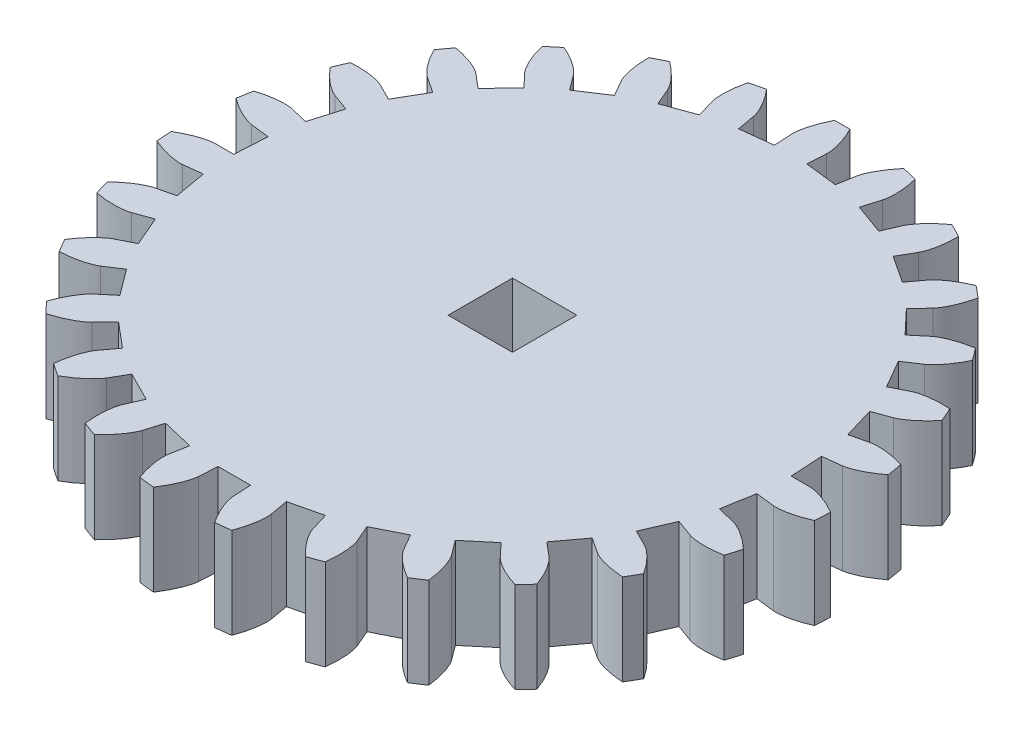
from build123d import *

# Parameters (mm, degrees)
BOSS_EXTRUDE1_DEPTH = 1
CIRPATTERN1_COUNT   = 27
BOSS_EXTRUDE2_START = -1
BOSS_EXTRUDE2_DEPTH = 1


with BuildPart() as part:
    # Sketch2 → Boss-Extrude1 (new body)
    with BuildSketch(Plane(origin=(0, 0, 0), x_dir=(1, 0, 0), z_dir=(0, 1, 0))):
        with BuildLine():
            Line((-3.245404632, -0.379333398), (-3.041792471, -0.35553455))
            Line((-3.041792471, -0.35553455), (-2.979949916, -0.706261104))
            Line((-2.979949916, -0.706261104), (-0.486522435, -0.115307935))
            ThreePointArc((-0.486522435, -0.115307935), (-0.496619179, -0.058046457), (-0.5, 0))
            Line((-0.5, 0), (-3.267498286, 0))
            add(Edge.make_bspline(
                [(-3.267498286, 0), (-3.271915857, 0), (-3.284293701, -0.000454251), (-3.307607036, -0.003105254), (-3.345284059, -0.009957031), (-3.392581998, -0.022359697), (-3.452571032, -0.042534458), (-3.518674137, -0.070344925), (-3.569478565, -0.095824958), (-3.606016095, -0.116178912), (-3.622810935, -0.125960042)],
                knots=[0, 0, 0, 0, 0, 0.005376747, 0.015083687, 0.028531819, 0.046610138, 0.064854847, 0.092110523, 0.115778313, 0.115778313, 0.115778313, 0.115778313, 0.115778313], degree=4))
            ThreePointArc((-3.622810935, -0.125960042), (-3.618867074, -0.210775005), (-3.612937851, -0.295474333))
            add(Edge.make_bspline(
                [(-3.245404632, -0.379333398), (-3.249792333, -0.379846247), (-3.262139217, -0.380832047), (-3.285602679, -0.380905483), (-3.323820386, -0.37847407), (-3.372238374, -0.371646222), (-3.434163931, -0.358572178), (-3.503048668, -0.338623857), (-3.556467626, -0.319214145), (-3.595121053, -0.303239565), (-3.612937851, -0.295474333)],
                knots=[0, 0, 0, 0, 0, 0.005376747, 0.015083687, 0.028531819, 0.046610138, 0.064854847, 0.092110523, 0.115778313, 0.115778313, 0.115778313, 0.115778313, 0.115778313], degree=4))
        make_face()
    boss_extrude1 = extrude(amount=BOSS_EXTRUDE1_DEPTH)

    # CirPattern1: Boss-Extrude1 ×27 about axis
    cirpattern1_axis = Axis((0, 0, 0), (0, -1, 0))
    for i in range(1, CIRPATTERN1_COUNT):
        add(boss_extrude1.rotate(cirpattern1_axis, i * 360 / CIRPATTERN1_COUNT))

    # Sketch3 → Boss-Extrude2 (add)
    with BuildSketch(Plane(origin=(0, 1, 0), x_dir=(1, 0, 0), z_dir=(0, 1, 0)).offset(BOSS_EXTRUDE2_START)):
        with BuildLine():
            ThreePointArc((-0.353553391, 0.353553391), (-0.5, 0), (-0.353553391, -0.353553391))
            Line((-0.353553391, -0.353553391), (-0.353553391, 0.353553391))
        make_face()
        with BuildLine():
            ThreePointArc((0.353553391, 0.353553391), (0, 0.5), (-0.353553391, 0.353553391))
            Line((-0.353553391, 0.353553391), (0.353553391, 0.353553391))
        make_face()
        with BuildLine():
            Line((0.353553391, 0.353553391), (0.353553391, -0.353553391))
            ThreePointArc((0.353553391, -0.353553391), (0.461939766, -0.191341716), (0.5, 0))
            ThreePointArc((0.5, 0), (0.461939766, 0.191341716), (0.353553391, 0.353553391))
        make_face()
        with BuildLine():
            Line((0.353553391, -0.353553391), (-0.353553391, -0.353553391))
            ThreePointArc((-0.353553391, -0.353553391), (0, -0.5), (0.353553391, -0.353553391))
        make_face()
    extrude(amount=BOSS_EXTRUDE2_DEPTH)


solid = part.part
